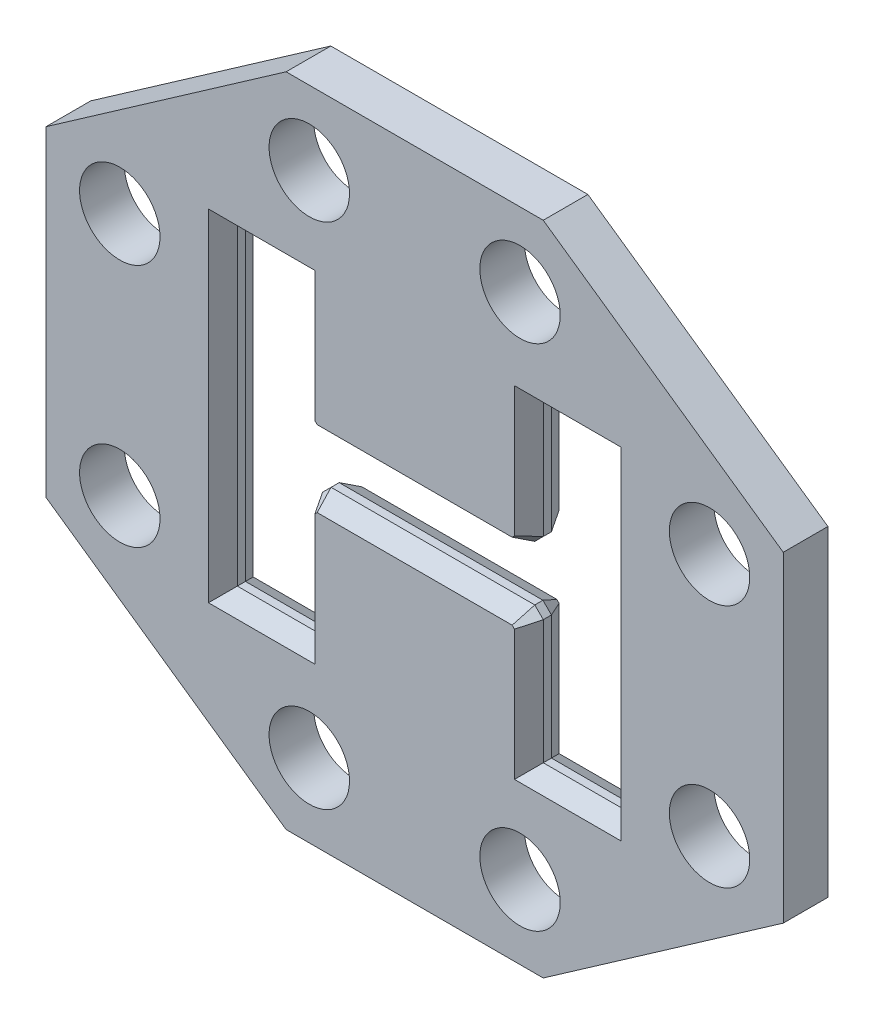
from build123d import *

# Parameters (mm, degrees)
MAIN_PLATE_DEPTH        = 31.75
SKETCH7_W               = 488.427889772
SKETCH7_H               = 597.424429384
EXTRUDE_W665_DEPTH      = 31.75
CUT_EXTRUDE1_DEPTH      = 703.061769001
CUT_EXTRUDE1_DEPTH_BACK = 703.061769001
SKETCH5_R               = 57.15
CHAMFER1_SIZE           = 15
CHAMFER1_SIZE2          = 25.980762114
CHAMFER2_SIZE           = 15
CHAMFER2_SIZE2          = 25.980762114


with BuildPart() as part:
    # Sketch3 → Main Plate (new, symmetric)
    with BuildSketch(Plane(origin=(0, 0, 0), x_dir=(0, 1, 0), z_dir=(0, 0, 1))):
        Polygon((228.234235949, 523.855268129), (466.324268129, 182.70492307), (466.324268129, -182.70492307), (228.234235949, -523.855268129), (-228.234235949, -523.855268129), (-466.324268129, -182.70492307), (-466.324268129, 182.70492307), (-228.234235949, 523.855268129), align=None)
        Polygon((-54.229, 156.845), (-230.378, 156.845), (-230.378, 287.909), (230.378, 287.909), (230.378, 156.845), (54.229, 156.845), (42.164, 144.78), (42.164, -144.78), (54.229, -156.845), (230.378, -156.845), (230.378, -287.909), (-230.378, -287.909), (-230.378, -156.845), (-54.229, -156.845), (-42.164, -144.78), (-42.164, 144.78), align=None, mode=Mode.SUBTRACT)
    extrude(amount=MAIN_PLATE_DEPTH, both=True)

    # Sketch7 → Extrude W665 (add, symmetric)
    with BuildSketch(Plane(origin=(0, 0, 0), x_dir=(0, 1, 0), z_dir=(0, 0, 1))):
        with Locations((1.882804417, 0.023527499)):
            Rectangle(SKETCH7_W, SKETCH7_H)
        Polygon((227.33, 278.003), (227.33, 156.845), (51.181, 156.845), (39.116, 144.78), (39.116, -144.78), (51.181, -156.845), (227.33, -156.845), (227.33, -278.003), (-227.33, -278.003), (-227.33, -156.845), (-51.181, -156.845), (-39.116, -144.78), (-39.116, 144.78), (-51.181, 156.845), (-227.33, 156.845), (-227.33, 278.003), align=None, mode=Mode.SUBTRACT)
    extrude(amount=EXTRUDE_W665_DEPTH, both=True)

    # Sketch5 → Cut-Extrude1 (cut, two sides: drawn at the far end of the back side and taken through both)
    with BuildSketch(Plane(origin=(0, 0, 0), x_dir=(0, 1, 0), z_dir=(0, 0, 1)).offset(-CUT_EXTRUDE1_DEPTH_BACK)):
        with Locations(Location((-173.588730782, 419.080268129, 0), (0, 0, 270))):
            Circle(SKETCH5_R)
        with Locations(Location((173.588730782, 419.080268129, 0), (0, 0, 270))):
            Circle(SKETCH5_R)
        with Locations(Location((361.549268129, 149.758610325, 0), (0, 0, 270))):
            Circle(SKETCH5_R)
        with Locations(Location((361.549268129, -149.758610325, 0), (0, 0, 270))):
            Circle(SKETCH5_R)
        with Locations(Location((173.588730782, -419.080268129, 0), (0, 0, 270))):
            Circle(SKETCH5_R)
        with Locations(Location((-173.588730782, -419.080268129, 0), (0, 0, 270))):
            Circle(SKETCH5_R)
        with Locations(Location((-361.549268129, -149.758610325, 0), (0, 0, 270))):
            Circle(SKETCH5_R)
        with Locations(Location((-361.549268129, 149.758610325, 0), (0, 0, 270))):
            Circle(SKETCH5_R)
    extrude(amount=CUT_EXTRUDE1_DEPTH + CUT_EXTRUDE1_DEPTH_BACK, mode=Mode.SUBTRACT)

    # Chamfer1
    chamfer1_edges = [part.edges().sort_by_distance(p)[0] for p in [
        (217.424, -227.33, 31.75),
        (278.003, 0, 31.75),
        (217.424, 227.33, 31.75),
        (150.8125, 45.1485, 31.75),
        (0, 39.116, 31.75),
        (-150.8125, 45.1485, 31.75),
        (-217.424, 227.33, 31.75),
        (-278.003, 0, 31.75),
        (-217.424, -227.33, 31.75),
        (-150.8125, -45.1485, 31.75),
        (0, -39.116, 31.75),
        (156.845, -139.2555, 31.75),
        (-156.845, 139.2555, 31.75),
        (-156.845, -139.2555, 31.75),
        (156.845, 139.2555, 31.75),
        (150.8125, -45.1485, 31.75),
    ]]
    chamfer1_side = [part.faces().sort_by_distance(p)[0] for p in [
        (-345.252406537, 335.776675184, 31.75),
    ]]
    chamfer(chamfer1_edges, length=CHAMFER1_SIZE, length2=CHAMFER1_SIZE2, reference=chamfer1_side[0])

    # Chamfer2
    chamfer2_edges = [part.edges().sort_by_distance(p)[0] for p in [
        (156.845, -139.2555, -31.75),
        (-156.845, 139.2555, -31.75),
        (-156.845, -139.2555, -31.75),
        (156.845, 139.2555, -31.75),
        (150.8125, 45.1485, -31.75),
        (0, 39.116, -31.75),
        (-150.8125, 45.1485, -31.75),
        (217.424, -227.33, -31.75),
        (278.003, 0, -31.75),
        (217.424, 227.33, -31.75),
        (-217.424, 227.33, -31.75),
        (-278.003, 0, -31.75),
        (-217.424, -227.33, -31.75),
        (-150.8125, -45.1485, -31.75),
        (0, -39.116, -31.75),
        (150.8125, -45.1485, -31.75),
    ]]
    chamfer2_side = [part.faces().sort_by_distance(p)[0] for p in [
        (-345.252406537, 335.776675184, -31.75),
    ]]
    chamfer(chamfer2_edges, length=CHAMFER2_SIZE, length2=CHAMFER2_SIZE2, reference=chamfer2_side[0])


solid = part.part
